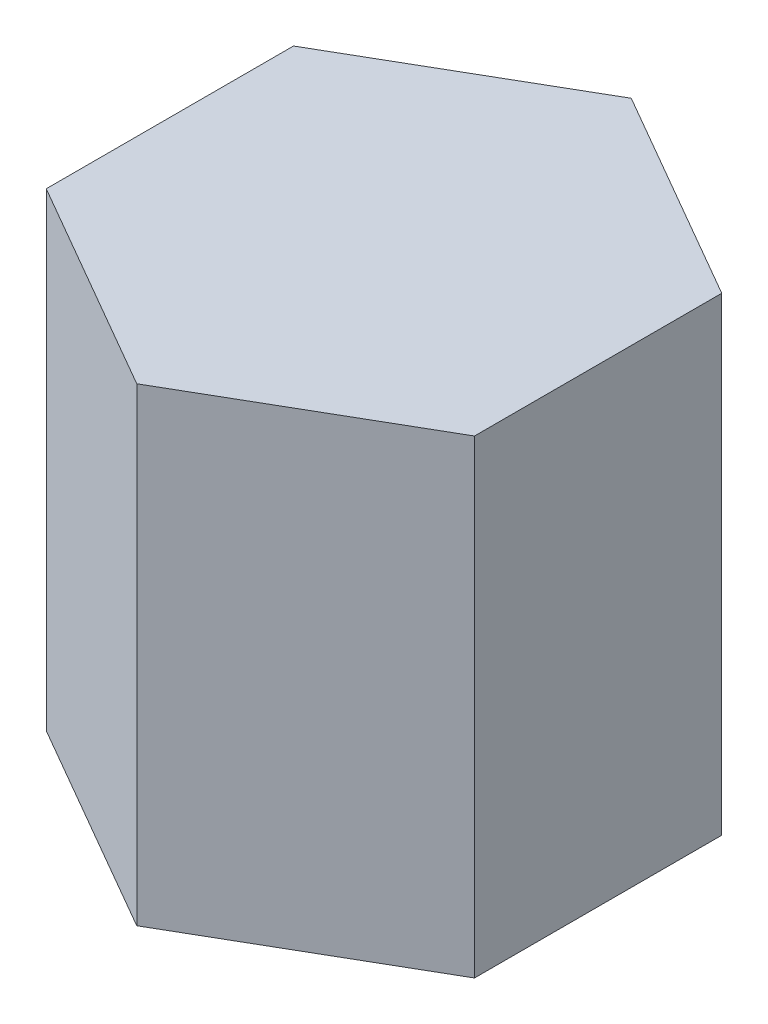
from build123d import *

# Parameters (mm, degrees)
EXTRUDE_1_DEPTH = 110


with BuildPart() as part:
    # Sketch 1 → Extrude 1 (new body)
    with BuildSketch(Plane(origin=(0, 0, 0), x_dir=(1, 0, 0), z_dir=(0, 1, 0))):
        Polygon((0, 57.942447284), (-50.179631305, 28.971223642), (-50.179631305, -28.971223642), (0, -57.942447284), (50.179631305, -28.971223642), (50.179631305, 28.971223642), align=None)
    extrude(amount=EXTRUDE_1_DEPTH)


solid = part.part
